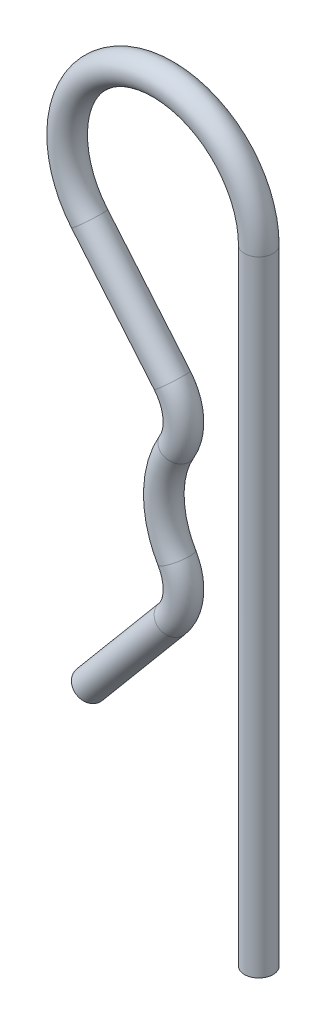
ISO-10303-21;
HEADER;
FILE_DESCRIPTION(('STEP AP214'),'2;1');
FILE_NAME('part.step','',(''),(''),'','','');
FILE_SCHEMA(('AUTOMOTIVE_DESIGN { 1 0 10303 214 1 1 1 1 }'));
ENDSEC;
DATA;
#1=APPLICATION_CONTEXT('core data for automotive mechanical design processes');
#2=APPLICATION_PROTOCOL_DEFINITION('international standard','automotive_design',2000,#1);
#3=PRODUCT_CONTEXT('',#1,'mechanical');
#4=PRODUCT('Part','Part','',(#3));
#5=PRODUCT_RELATED_PRODUCT_CATEGORY('part','',(#4));
#6=PRODUCT_DEFINITION_FORMATION('','',#4);
#7=PRODUCT_DEFINITION_CONTEXT('part definition',#1,'design');
#8=PRODUCT_DEFINITION('design','',#6,#7);
#9=PRODUCT_DEFINITION_SHAPE('','',#8);
#10=(LENGTH_UNIT() NAMED_UNIT(*) SI_UNIT(.MILLI.,.METRE.));
#11=(NAMED_UNIT(*) PLANE_ANGLE_UNIT() SI_UNIT($,.RADIAN.));
#12=(NAMED_UNIT(*) SI_UNIT($,.STERADIAN.) SOLID_ANGLE_UNIT());
#13=UNCERTAINTY_MEASURE_WITH_UNIT(LENGTH_MEASURE(1.E-05),#10,'distance_accuracy_value','');
#14=(GEOMETRIC_REPRESENTATION_CONTEXT(3) GLOBAL_UNCERTAINTY_ASSIGNED_CONTEXT((#13)) GLOBAL_UNIT_ASSIGNED_CONTEXT((#10,
#11,#12)) REPRESENTATION_CONTEXT('',''));
#15=CARTESIAN_POINT('',(0.,0.,0.));
#16=DIRECTION('',(0.,0.,1.));
#17=DIRECTION('',(1.,0.,0.));
#18=AXIS2_PLACEMENT_3D('',#15,#16,#17);
#19=CARTESIAN_POINT('',(-5.41821067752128,-6.46107522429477,0.));
#20=DIRECTION('',(-0.642559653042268,-0.766235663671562,0.));
#21=DIRECTION('',(0.766235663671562,-0.642559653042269,0.));
#22=AXIS2_PLACEMENT_3D('',#19,#20,#21);
#23=CYLINDRICAL_SURFACE('',#22,0.9);
#24=CARTESIAN_POINT('',(-5.41821067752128,-6.46107522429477,0.));
#25=DIRECTION('',(-0.64255965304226,-0.766235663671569,0.));
#26=DIRECTION('',(0.,0.,1.));
#27=AXIS2_PLACEMENT_3D('',#24,#25,#26);
#28=CIRCLE('',#27,0.9);
#29=CARTESIAN_POINT('',(-4.72859858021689,-7.03937891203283,0.));
#30=VERTEX_POINT('',#29);
#31=EDGE_CURVE('E30',#30,#30,#28,.T.);
#32=ORIENTED_EDGE('',*,*,#31,.T.);
#33=EDGE_LOOP('',(#32));
#34=FACE_BOUND('',#33,.T.);
#35=CARTESIAN_POINT('',(-10.5974139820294,-12.6371403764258,0.));
#36=DIRECTION('',(-0.64255965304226,-0.766235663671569,0.));
#37=DIRECTION('',(0.,0.,1.));
#38=AXIS2_PLACEMENT_3D('',#35,#36,#37);
#39=CIRCLE('',#38,0.9);
#40=CARTESIAN_POINT('',(-10.5974139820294,-12.6371403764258,0.9));
#41=VERTEX_POINT('',#40);
#42=EDGE_CURVE('E10',#41,#41,#39,.T.);
#43=ORIENTED_EDGE('',*,*,#42,.F.);
#44=EDGE_LOOP('',(#43));
#45=FACE_BOUND('',#44,.T.);
#46=ADVANCED_FACE('F24',(#34,#45),#23,.T.);
#47=CARTESIAN_POINT('',(-7.71691766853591,-4.5333962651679,0.));
#48=DIRECTION('',(0.,0.,-1.));
#49=DIRECTION('',(-1.,0.,0.));
#50=AXIS2_PLACEMENT_3D('',#47,#48,#49);
#51=TOROIDAL_SURFACE('',#50,3.,0.9);
#52=CARTESIAN_POINT('',(-5.13024135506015,-3.01382209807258,0.));
#53=DIRECTION('',(0.50652472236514,-0.862225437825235,0.));
#54=DIRECTION('',(0.,0.,1.));
#55=AXIS2_PLACEMENT_3D('',#52,#53,#54);
#56=CIRCLE('',#55,0.9);
#57=CARTESIAN_POINT('',(-4.35423846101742,-2.55794984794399,0.));
#58=VERTEX_POINT('',#57);
#59=EDGE_CURVE('E34',#58,#58,#56,.T.);
#60=CARTESIAN_POINT('',(-7.71691766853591,-4.5333962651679,0.));
#61=DIRECTION('',(0.,0.,-1.));
#62=DIRECTION('',(-1.,0.,0.));
#63=AXIS2_PLACEMENT_3D('',#60,#61,#62);
#64=CIRCLE('',#63,3.9);
#65=EDGE_CURVE('',#58,#30,#64,.T.);
#66=ORIENTED_EDGE('',*,*,#59,.T.);
#67=ORIENTED_EDGE('',*,*,#31,.F.);
#68=ORIENTED_EDGE('',*,*,#65,.T.);
#69=ORIENTED_EDGE('',*,*,#65,.F.);
#70=EDGE_LOOP('',(#66,#68,#67,#69));
#71=FACE_BOUND('',#70,.T.);
#72=ADVANCED_FACE('F67',(#71),#51,.T.);
#73=CARTESIAN_POINT('',(0.,0.,0.));
#74=DIRECTION('',(0.,0.,1.));
#75=DIRECTION('',(1.,0.,0.));
#76=AXIS2_PLACEMENT_3D('',#73,#74,#75);
#77=TOROIDAL_SURFACE('',#76,5.95,0.9);
#78=CARTESIAN_POINT('',(-5.13024135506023,3.01382209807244,0.));
#79=DIRECTION('',(-0.506524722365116,-0.862225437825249,0.));
#80=DIRECTION('',(0.,0.,1.));
#81=AXIS2_PLACEMENT_3D('',#78,#79,#80);
#82=CIRCLE('',#81,0.9);
#83=CARTESIAN_POINT('',(-4.35423846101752,2.55794984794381,0.));
#84=VERTEX_POINT('',#83);
#85=EDGE_CURVE('E38',#84,#84,#82,.T.);
#86=ORIENTED_EDGE('',*,*,#85,.T.);
#87=EDGE_LOOP('',(#86));
#88=FACE_BOUND('',#87,.T.);
#89=ORIENTED_EDGE('',*,*,#59,.F.);
#90=EDGE_LOOP('',(#89));
#91=FACE_BOUND('',#90,.T.);
#92=ADVANCED_FACE('F71',(#88,#91),#77,.T.);
#93=CARTESIAN_POINT('',(-7.71691766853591,4.5333962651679,0.));
#94=DIRECTION('',(0.,0.,-1.));
#95=DIRECTION('',(-1.,0.,0.));
#96=AXIS2_PLACEMENT_3D('',#93,#94,#95);
#97=TOROIDAL_SURFACE('',#96,3.,0.9);
#98=CARTESIAN_POINT('',(-5.41821067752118,6.46107522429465,0.));
#99=DIRECTION('',(0.642559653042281,-0.766235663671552,0.));
#100=DIRECTION('',(0.,0.,1.));
#101=AXIS2_PLACEMENT_3D('',#98,#99,#100);
#102=CIRCLE('',#101,0.9);
#103=CARTESIAN_POINT('',(-4.72859858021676,7.03937891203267,0.));
#104=VERTEX_POINT('',#103);
#105=EDGE_CURVE('E43',#104,#104,#102,.T.);
#106=CARTESIAN_POINT('',(-7.71691766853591,4.5333962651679,0.));
#107=DIRECTION('',(0.,0.,-1.));
#108=DIRECTION('',(-1.,0.,0.));
#109=AXIS2_PLACEMENT_3D('',#106,#107,#108);
#110=CIRCLE('',#109,3.9);
#111=EDGE_CURVE('',#104,#84,#110,.T.);
#112=ORIENTED_EDGE('',*,*,#105,.T.);
#113=ORIENTED_EDGE('',*,*,#85,.F.);
#114=ORIENTED_EDGE('',*,*,#111,.T.);
#115=ORIENTED_EDGE('',*,*,#111,.F.);
#116=EDGE_LOOP('',(#112,#114,#113,#115));
#117=FACE_BOUND('',#116,.T.);
#118=ADVANCED_FACE('F77',(#117),#97,.T.);
#119=CARTESIAN_POINT('',(-10.5974139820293,12.6371403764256,0.));
#120=DIRECTION('',(0.642559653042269,-0.766235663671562,0.));
#121=DIRECTION('',(0.766235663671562,0.642559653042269,0.));
#122=AXIS2_PLACEMENT_3D('',#119,#120,#121);
#123=CYLINDRICAL_SURFACE('',#122,0.9);
#124=CARTESIAN_POINT('',(-10.5974139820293,12.6371403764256,0.));
#125=DIRECTION('',(0.642559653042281,-0.766235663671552,0.));
#126=DIRECTION('',(0.,0.,1.));
#127=AXIS2_PLACEMENT_3D('',#124,#125,#126);
#128=CIRCLE('',#127,0.9);
#129=CARTESIAN_POINT('',(-11.2870260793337,12.0588366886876,0.));
#130=VERTEX_POINT('',#129);
#131=EDGE_CURVE('E46',#130,#130,#128,.T.);
#132=ORIENTED_EDGE('',*,*,#131,.T.);
#133=EDGE_LOOP('',(#132));
#134=FACE_BOUND('',#133,.T.);
#135=ORIENTED_EDGE('',*,*,#105,.F.);
#136=EDGE_LOOP('',(#135));
#137=FACE_BOUND('',#136,.T.);
#138=ADVANCED_FACE('F84',(#134,#137),#123,.T.);
#139=CARTESIAN_POINT('',(-6.,16.4924982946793,0.));
#140=DIRECTION('',(0.,0.,1.));
#141=DIRECTION('',(1.,0.,0.));
#142=AXIS2_PLACEMENT_3D('',#139,#140,#141);
#143=TOROIDAL_SURFACE('',#142,6.,0.9);
#144=CARTESIAN_POINT('',(0.,16.4924982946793,0.));
#145=DIRECTION('',(0.,1.,0.));
#146=DIRECTION('',(0.,0.,1.));
#147=AXIS2_PLACEMENT_3D('',#144,#145,#146);
#148=CIRCLE('',#147,0.9);
#149=CARTESIAN_POINT('',(0.899999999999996,16.4924982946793,0.));
#150=VERTEX_POINT('',#149);
#151=EDGE_CURVE('E49',#150,#150,#148,.T.);
#152=CARTESIAN_POINT('',(-6.,16.4924982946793,0.));
#153=DIRECTION('',(0.,0.,1.));
#154=DIRECTION('',(1.,0.,0.));
#155=AXIS2_PLACEMENT_3D('',#152,#153,#154);
#156=CIRCLE('',#155,6.9);
#157=EDGE_CURVE('',#150,#130,#156,.T.);
#158=ORIENTED_EDGE('',*,*,#151,.T.);
#159=ORIENTED_EDGE('',*,*,#131,.F.);
#160=ORIENTED_EDGE('',*,*,#157,.T.);
#161=ORIENTED_EDGE('',*,*,#157,.F.);
#162=EDGE_LOOP('',(#158,#160,#159,#161));
#163=FACE_BOUND('',#162,.T.);
#164=ADVANCED_FACE('F88',(#163),#143,.T.);
#165=CARTESIAN_POINT('',(0.,16.4924982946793,0.));
#166=DIRECTION('',(0.,-1.,0.));
#167=DIRECTION('',(1.,0.,0.));
#168=AXIS2_PLACEMENT_3D('',#165,#166,#167);
#169=CYLINDRICAL_SURFACE('',#168,0.9);
#170=ORIENTED_EDGE('',*,*,#151,.F.);
#171=EDGE_LOOP('',(#170));
#172=FACE_BOUND('',#171,.T.);
#173=CARTESIAN_POINT('',(0.,-22.6075017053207,0.));
#174=DIRECTION('',(0.,1.,0.));
#175=DIRECTION('',(0.,0.,1.));
#176=AXIS2_PLACEMENT_3D('',#173,#174,#175);
#177=CIRCLE('',#176,0.9);
#178=CARTESIAN_POINT('',(0.,-22.6075017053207,0.9));
#179=VERTEX_POINT('',#178);
#180=EDGE_CURVE('E52',#179,#179,#177,.T.);
#181=ORIENTED_EDGE('',*,*,#180,.T.);
#182=EDGE_LOOP('',(#181));
#183=FACE_BOUND('',#182,.T.);
#184=ADVANCED_FACE('F56',(#172,#183),#169,.T.);
#185=CARTESIAN_POINT('',(-10.5974139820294,-12.6371403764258,0.));
#186=DIRECTION('',(-0.64255965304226,-0.766235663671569,0.));
#187=DIRECTION('',(0.,0.,1.));
#188=AXIS2_PLACEMENT_3D('',#185,#186,#187);
#189=PLANE('',#188);
#190=ORIENTED_EDGE('',*,*,#42,.T.);
#191=EDGE_LOOP('',(#190));
#192=FACE_BOUND('',#191,.T.);
#193=ADVANCED_FACE('F60',(#192),#189,.T.);
#194=CARTESIAN_POINT('',(0.,-22.6075017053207,0.));
#195=DIRECTION('',(0.,1.,0.));
#196=DIRECTION('',(0.,0.,1.));
#197=AXIS2_PLACEMENT_3D('',#194,#195,#196);
#198=PLANE('',#197);
#199=ORIENTED_EDGE('',*,*,#180,.F.);
#200=EDGE_LOOP('',(#199));
#201=FACE_BOUND('',#200,.T.);
#202=ADVANCED_FACE('F58',(#201),#198,.F.);
#203=CLOSED_SHELL('',(#46,#72,#92,#118,#138,#164,#184,#193,#202));
#204=MANIFOLD_SOLID_BREP('B2',#203);
#205=ADVANCED_BREP_SHAPE_REPRESENTATION('',(#18,#204),#14);
#206=SHAPE_DEFINITION_REPRESENTATION(#9,#205);
ENDSEC;
END-ISO-10303-21;
